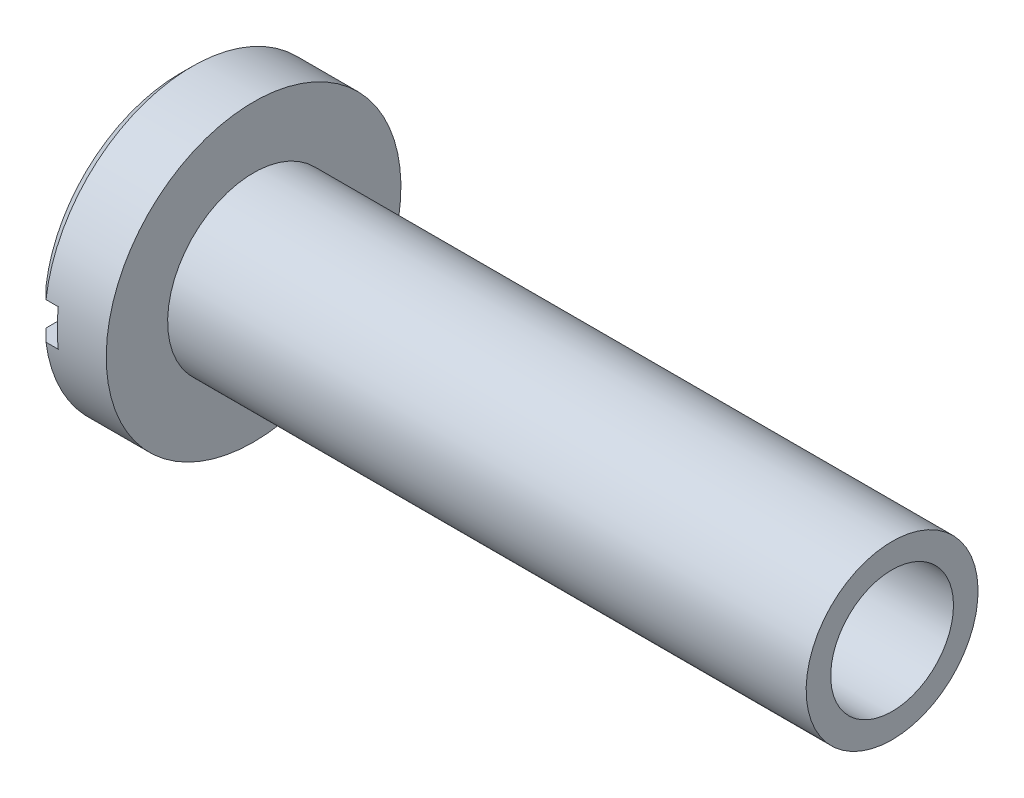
from build123d import *

# Parameters (mm, degrees)
M2_5X0_45_TAPPED_HOLE1_D           = 2.05
M2_5X0_45_TAPPED_HOLE1_DEPTH       = 7.35
M2_5X0_45_TAPPED_HOLE1_CBORE_D     = 2.5
M2_5X0_45_TAPPED_HOLE1_CBORE_DEPTH = 6
M2_5X0_45_TAPPED_HOLE1_TIP         = 0.615882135
CUT_EXTRUDE1_DEPTH                 = 16.10794493
CUT_EXTRUDE1_DEPTH_BACK            = 16.10794493
SKETCH4_W                          = 0.5
SKETCH4_H                          = 0.75
CHAMFER1_SIZE                      = 0.25


with BuildPart() as part:
    # Sketch1 → Base-Revolve (revolve)
    with BuildSketch(Plane.XY, mode=Mode.PRIVATE) as base_revolve_sk:
        Polygon((0, 0), (0, 3), (1.5, 3), (1.5, 1.75), (14.5, 1.75), (14.5, 0), align=None)
    revolve(base_revolve_sk.sketch.rotate(Axis((0, 0, 0), (1, 0, 0)), 180), axis=Axis((0, 0, 0), (1, 0, 0)))

    # M2.5x0.45 Tapped Hole1
    with Locations(Plane(origin=(14.5, 0, 0), x_dir=(0, 0, -1), z_dir=(1, 0, 0))):
        with Locations((0, 0)):
            CounterBoreHole(M2_5X0_45_TAPPED_HOLE1_D / 2, M2_5X0_45_TAPPED_HOLE1_CBORE_D / 2, M2_5X0_45_TAPPED_HOLE1_CBORE_DEPTH, depth=M2_5X0_45_TAPPED_HOLE1_DEPTH)
            with Locations((0, 0, -(M2_5X0_45_TAPPED_HOLE1_DEPTH + M2_5X0_45_TAPPED_HOLE1_TIP / 2))):  # 118° drill point
                Cone(0, M2_5X0_45_TAPPED_HOLE1_D / 2, M2_5X0_45_TAPPED_HOLE1_TIP, mode=Mode.SUBTRACT)

    # Sketch4 → Cut-Extrude1 (cut, two sides: drawn at the far end of the back side and taken through both)
    with BuildSketch(Plane.XY.offset(-CUT_EXTRUDE1_DEPTH_BACK)):
        with Locations((0.25, 0)):
            Rectangle(SKETCH4_W, SKETCH4_H)
    extrude(amount=CUT_EXTRUDE1_DEPTH + CUT_EXTRUDE1_DEPTH_BACK, mode=Mode.SUBTRACT)

    # Chamfer1
    chamfer1_edges = [part.edges().sort_by_distance(p)[0] for p in [
        (0, 3, 0),
        (0, -2.25, -1.984313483),
    ]]
    chamfer(chamfer1_edges, length=CHAMFER1_SIZE)


solid = part.part
